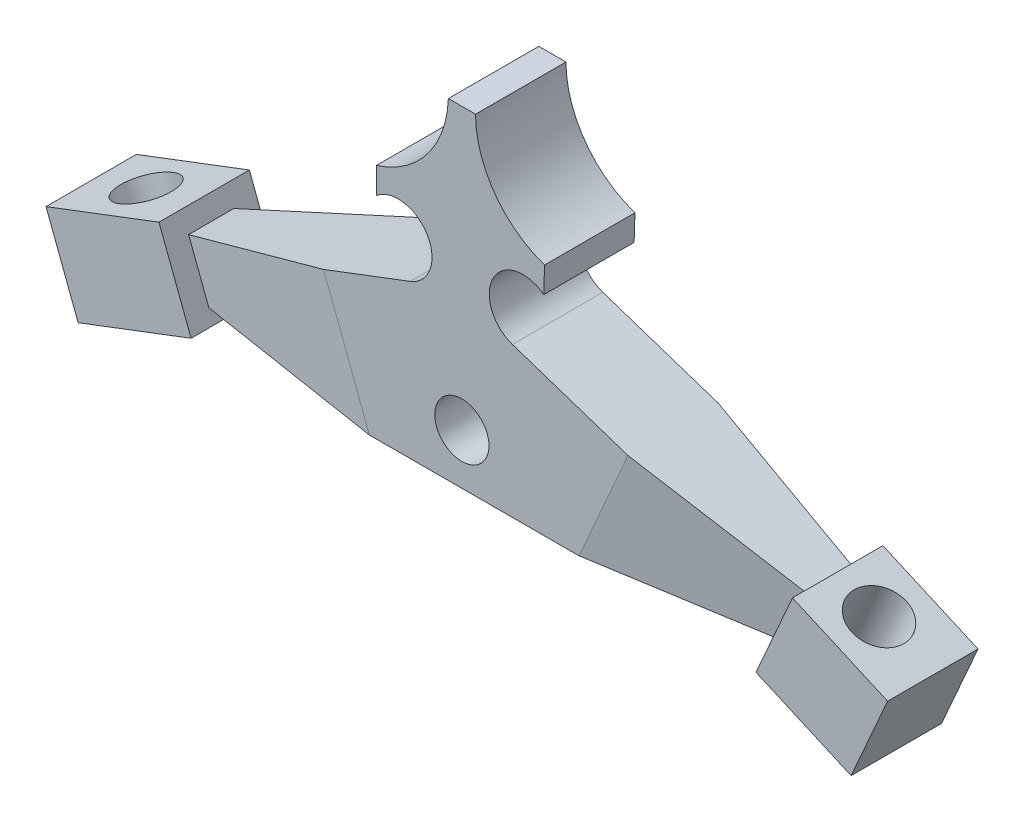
ISO-10303-21;
HEADER;
FILE_DESCRIPTION(('STEP AP214'),'2;1');
FILE_NAME('part.step','',(''),(''),'','','');
FILE_SCHEMA(('AUTOMOTIVE_DESIGN { 1 0 10303 214 1 1 1 1 }'));
ENDSEC;
DATA;
#1=APPLICATION_CONTEXT('core data for automotive mechanical design processes');
#2=APPLICATION_PROTOCOL_DEFINITION('international standard','automotive_design',2000,#1);
#3=PRODUCT_CONTEXT('',#1,'mechanical');
#4=PRODUCT('Part','Part','',(#3));
#5=PRODUCT_RELATED_PRODUCT_CATEGORY('part','',(#4));
#6=PRODUCT_DEFINITION_FORMATION('','',#4);
#7=PRODUCT_DEFINITION_CONTEXT('part definition',#1,'design');
#8=PRODUCT_DEFINITION('design','',#6,#7);
#9=PRODUCT_DEFINITION_SHAPE('','',#8);
#10=(LENGTH_UNIT() NAMED_UNIT(*) SI_UNIT(.MILLI.,.METRE.));
#11=(NAMED_UNIT(*) PLANE_ANGLE_UNIT() SI_UNIT($,.RADIAN.));
#12=(NAMED_UNIT(*) SI_UNIT($,.STERADIAN.) SOLID_ANGLE_UNIT());
#13=UNCERTAINTY_MEASURE_WITH_UNIT(LENGTH_MEASURE(1.E-05),#10,'distance_accuracy_value','');
#14=(GEOMETRIC_REPRESENTATION_CONTEXT(3) GLOBAL_UNCERTAINTY_ASSIGNED_CONTEXT((#13)) GLOBAL_UNIT_ASSIGNED_CONTEXT((#10,
#11,#12)) REPRESENTATION_CONTEXT('',''));
#15=CARTESIAN_POINT('',(0.,0.,0.));
#16=DIRECTION('',(0.,0.,1.));
#17=DIRECTION('',(1.,0.,0.));
#18=AXIS2_PLACEMENT_3D('',#15,#16,#17);
#19=CARTESIAN_POINT('',(0.,0.,0.));
#20=DIRECTION('',(0.,0.,1.));
#21=DIRECTION('',(1.,0.,0.));
#22=AXIS2_PLACEMENT_3D('',#19,#20,#21);
#23=PLANE('',#22);
#24=DIRECTION('',(-0.403545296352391,-0.914959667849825,0.));
#25=VECTOR('',#24,1.);
#26=CARTESIAN_POINT('',(36.5740452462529,2.21945965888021,0.));
#27=LINE('',#26,#25);
#28=CARTESIAN_POINT('',(36.5740452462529,2.21945965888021,0.));
#29=VERTEX_POINT('',#28);
#30=CARTESIAN_POINT('',(32.538592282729,-6.93013701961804,0.));
#31=VERTEX_POINT('',#30);
#32=EDGE_CURVE('E331',#29,#31,#27,.T.);
#33=ORIENTED_EDGE('',*,*,#32,.F.);
#34=DIRECTION('',(-0.914959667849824,0.403545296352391,0.));
#35=VECTOR('',#34,1.);
#36=CARTESIAN_POINT('',(36.5740452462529,2.21945965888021,0.));
#37=LINE('',#36,#35);
#38=CARTESIAN_POINT('',(47.0960814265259,-2.42131124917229,0.));
#39=VERTEX_POINT('',#38);
#40=EDGE_CURVE('E330',#39,#29,#37,.T.);
#41=ORIENTED_EDGE('',*,*,#40,.F.);
#42=DIRECTION('',(0.403545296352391,0.914959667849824,0.));
#43=VECTOR('',#42,1.);
#44=CARTESIAN_POINT('',(47.0960814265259,-2.42131124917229,0.));
#45=LINE('',#44,#43);
#46=CARTESIAN_POINT('',(43.060628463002,-11.5709079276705,0.));
#47=VERTEX_POINT('',#46);
#48=EDGE_CURVE('E348',#47,#39,#45,.T.);
#49=ORIENTED_EDGE('',*,*,#48,.F.);
#50=DIRECTION('',(0.914959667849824,-0.403545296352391,0.));
#51=VECTOR('',#50,1.);
#52=CARTESIAN_POINT('',(32.538592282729,-6.93013701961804,0.));
#53=LINE('',#52,#51);
#54=EDGE_CURVE('E346',#31,#47,#53,.T.);
#55=ORIENTED_EDGE('',*,*,#54,.F.);
#56=EDGE_LOOP('',(#33,#41,#49,#55));
#57=FACE_BOUND('',#56,.T.);
#58=ADVANCED_FACE('F33',(#57),#23,.F.);
#59=CARTESIAN_POINT('',(0.,0.,10.));
#60=DIRECTION('',(0.,0.,1.));
#61=DIRECTION('',(1.,0.,0.));
#62=AXIS2_PLACEMENT_3D('',#59,#60,#61);
#63=PLANE('',#62);
#64=DIRECTION('',(-0.999999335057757,-0.00115320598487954,0.));
#65=VECTOR('',#64,1.);
#66=CARTESIAN_POINT('',(-10.2343078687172,-5.58758670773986,10.));
#67=LINE('',#66,#65);
#68=CARTESIAN_POINT('',(12.949396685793,-5.56085110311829,10.));
#69=VERTEX_POINT('',#68);
#70=CARTESIAN_POINT('',(-10.2343078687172,-5.58758670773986,10.));
#71=VERTEX_POINT('',#70);
#72=EDGE_CURVE('E211',#69,#71,#67,.T.);
#73=ORIENTED_EDGE('',*,*,#72,.F.);
#74=DIRECTION('',(0.403545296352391,0.914959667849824,0.));
#75=VECTOR('',#74,1.);
#76=CARTESIAN_POINT('',(11.194897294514,-9.53883373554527,10.));
#77=LINE('',#76,#75);
#78=CARTESIAN_POINT('',(18.3801163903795,6.75223875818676,10.));
#79=VERTEX_POINT('',#78);
#80=EDGE_CURVE('E506',#69,#79,#77,.T.);
#81=ORIENTED_EDGE('',*,*,#80,.T.);
#82=DIRECTION('',(-0.948954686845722,0.315412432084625,0.));
#83=VECTOR('',#82,1.);
#84=CARTESIAN_POINT('',(18.3801163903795,6.75223875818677,10.));
#85=LINE('',#84,#83);
#86=CARTESIAN_POINT('',(5.59187159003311,11.0027803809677,10.));
#87=VERTEX_POINT('',#86);
#88=EDGE_CURVE('E264',#79,#87,#85,.T.);
#89=ORIENTED_EDGE('',*,*,#88,.T.);
#90=CARTESIAN_POINT('',(6.7714184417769,14.5515831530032,10.));
#91=DIRECTION('',(0.,0.,-1.));
#92=DIRECTION('',(-1.,0.,0.));
#93=AXIS2_PLACEMENT_3D('',#90,#91,#92);
#94=CIRCLE('',#93,3.73969676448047);
#95=CARTESIAN_POINT('',(9.0578474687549,17.5109030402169,10.));
#96=VERTEX_POINT('',#95);
#97=EDGE_CURVE('E265',#87,#96,#94,.T.);
#98=ORIENTED_EDGE('',*,*,#97,.T.);
#99=DIRECTION('',(0.0307893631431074,0.999525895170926,0.));
#100=VECTOR('',#99,1.);
#101=CARTESIAN_POINT('',(9.14667942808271,20.3946860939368,10.));
#102=LINE('',#101,#100);
#103=CARTESIAN_POINT('',(9.14667942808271,20.3946860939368,10.));
#104=VERTEX_POINT('',#103);
#105=EDGE_CURVE('E267',#96,#104,#102,.T.);
#106=ORIENTED_EDGE('',*,*,#105,.T.);
#107=CARTESIAN_POINT('',(12.7833787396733,31.065624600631,10.));
#108=DIRECTION('',(0.,0.,-1.));
#109=DIRECTION('',(1.,0.,0.));
#110=AXIS2_PLACEMENT_3D('',#107,#108,#109);
#111=CIRCLE('',#110,11.2736201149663);
#112=CARTESIAN_POINT('',(1.50985250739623,31.0196160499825,10.));
#113=VERTEX_POINT('',#112);
#114=EDGE_CURVE('E269',#104,#113,#111,.T.);
#115=ORIENTED_EDGE('',*,*,#114,.T.);
#116=DIRECTION('',(-1.,0.,0.));
#117=VECTOR('',#116,1.);
#118=CARTESIAN_POINT('',(1.50985250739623,31.0196160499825,10.));
#119=LINE('',#118,#117);
#120=CARTESIAN_POINT('',(-1.49014749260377,31.0196160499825,10.));
#121=VERTEX_POINT('',#120);
#122=EDGE_CURVE('E271',#113,#121,#119,.T.);
#123=ORIENTED_EDGE('',*,*,#122,.T.);
#124=CARTESIAN_POINT('',(-12.7569123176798,31.4127074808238,10.));
#125=DIRECTION('',(0.,0.,-1.));
#126=DIRECTION('',(-1.,0.,0.));
#127=AXIS2_PLACEMENT_3D('',#124,#125,#126);
#128=CIRCLE('',#127,11.2736201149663);
#129=CARTESIAN_POINT('',(-9.45048858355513,20.6348564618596,10.));
#130=VERTEX_POINT('',#129);
#131=EDGE_CURVE('E255',#121,#130,#128,.T.);
#132=ORIENTED_EDGE('',*,*,#131,.T.);
#133=DIRECTION('',(0.,-1.,0.));
#134=VECTOR('',#133,1.);
#135=CARTESIAN_POINT('',(-9.45048858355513,20.6348564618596,10.));
#136=LINE('',#135,#134);
#137=CARTESIAN_POINT('',(-9.45048858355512,17.749705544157,10.));
#138=VERTEX_POINT('',#137);
#139=EDGE_CURVE('E258',#130,#138,#136,.T.);
#140=ORIENTED_EDGE('',*,*,#139,.T.);
#141=CARTESIAN_POINT('',(-7.03993104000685,14.890589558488,10.));
#142=DIRECTION('',(0.,0.,-1.));
#143=DIRECTION('',(1.,0.,0.));
#144=AXIS2_PLACEMENT_3D('',#141,#142,#143);
#145=CIRCLE('',#144,3.73969676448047);
#146=CARTESIAN_POINT('',(-5.71010838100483,11.3953208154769,10.));
#147=VERTEX_POINT('',#146);
#148=EDGE_CURVE('E261',#138,#147,#145,.T.);
#149=ORIENTED_EDGE('',*,*,#148,.T.);
#150=DIRECTION('',(-0.934639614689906,-0.355596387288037,0.));
#151=VECTOR('',#150,1.);
#152=CARTESIAN_POINT('',(-15.3065735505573,7.74421477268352,10.));
#153=LINE('',#152,#151);
#154=CARTESIAN_POINT('',(-15.3065735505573,7.74421477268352,10.));
#155=VERTEX_POINT('',#154);
#156=EDGE_CURVE('E588',#147,#155,#153,.T.);
#157=ORIENTED_EDGE('',*,*,#156,.T.);
#158=DIRECTION('',(-0.355596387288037,0.934639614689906,0.));
#159=VECTOR('',#158,1.);
#160=CARTESIAN_POINT('',(-9.97262774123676,-6.27537944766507,10.));
#161=LINE('',#160,#159);
#162=EDGE_CURVE('E494',#71,#155,#161,.T.);
#163=ORIENTED_EDGE('',*,*,#162,.F.);
#164=EDGE_LOOP('',(#73,#81,#89,#98,#106,#115,#123,#132,#140,#149,#157,#163));
#165=FACE_BOUND('',#164,.T.);
#166=CARTESIAN_POINT('',(0.,0.,10.));
#167=DIRECTION('',(0.,0.,1.));
#168=DIRECTION('',(1.,0.,0.));
#169=AXIS2_PLACEMENT_3D('',#166,#167,#168);
#170=CIRCLE('',#169,3.);
#171=CARTESIAN_POINT('',(3.,0.,10.));
#172=VERTEX_POINT('',#171);
#173=EDGE_CURVE('E236',#172,#172,#170,.T.);
#174=ORIENTED_EDGE('',*,*,#173,.F.);
#175=EDGE_LOOP('',(#174));
#176=FACE_BOUND('',#175,.T.);
#177=ADVANCED_FACE('F385',(#165,#176),#63,.T.);
#178=DIRECTION('',(-0.403545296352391,-0.914959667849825,0.));
#179=VECTOR('',#178,1.);
#180=CARTESIAN_POINT('',(36.5740452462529,2.21945965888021,10.));
#181=LINE('',#180,#179);
#182=CARTESIAN_POINT('',(36.5740452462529,2.21945965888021,10.));
#183=VERTEX_POINT('',#182);
#184=CARTESIAN_POINT('',(32.538592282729,-6.93013701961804,10.));
#185=VERTEX_POINT('',#184);
#186=EDGE_CURVE('E326',#183,#185,#181,.T.);
#187=ORIENTED_EDGE('',*,*,#186,.T.);
#188=DIRECTION('',(0.914959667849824,-0.403545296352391,0.));
#189=VECTOR('',#188,1.);
#190=CARTESIAN_POINT('',(32.538592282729,-6.93013701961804,10.));
#191=LINE('',#190,#189);
#192=CARTESIAN_POINT('',(43.060628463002,-11.5709079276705,10.));
#193=VERTEX_POINT('',#192);
#194=EDGE_CURVE('E329',#185,#193,#191,.T.);
#195=ORIENTED_EDGE('',*,*,#194,.T.);
#196=DIRECTION('',(0.403545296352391,0.914959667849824,0.));
#197=VECTOR('',#196,1.);
#198=CARTESIAN_POINT('',(47.0960814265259,-2.42131124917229,10.));
#199=LINE('',#198,#197);
#200=CARTESIAN_POINT('',(47.0960814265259,-2.42131124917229,10.));
#201=VERTEX_POINT('',#200);
#202=EDGE_CURVE('E340',#193,#201,#199,.T.);
#203=ORIENTED_EDGE('',*,*,#202,.T.);
#204=DIRECTION('',(-0.914959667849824,0.403545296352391,0.));
#205=VECTOR('',#204,1.);
#206=CARTESIAN_POINT('',(36.5740452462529,2.21945965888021,10.));
#207=LINE('',#206,#205);
#208=EDGE_CURVE('E342',#201,#183,#207,.T.);
#209=ORIENTED_EDGE('',*,*,#208,.T.);
#210=EDGE_LOOP('',(#187,#195,#203,#209));
#211=FACE_BOUND('',#210,.T.);
#212=ADVANCED_FACE('F382',(#211),#63,.T.);
#213=CARTESIAN_POINT('',(18.3801163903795,6.75223875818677,10.));
#214=DIRECTION('',(-0.315412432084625,-0.948954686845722,0.));
#215=DIRECTION('',(0.948954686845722,-0.315412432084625,0.));
#216=AXIS2_PLACEMENT_3D('',#213,#214,#215);
#217=PLANE('',#216);
#218=DIRECTION('',(0.,0.,-1.));
#219=VECTOR('',#218,1.);
#220=CARTESIAN_POINT('',(35.9914750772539,0.898596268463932,10.));
#221=LINE('',#220,#219);
#222=CARTESIAN_POINT('',(35.9914750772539,0.89859626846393,7.5));
#223=VERTEX_POINT('',#222);
#224=CARTESIAN_POINT('',(35.9914750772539,0.898596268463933,2.5));
#225=VERTEX_POINT('',#224);
#226=EDGE_CURVE('E238',#223,#225,#221,.T.);
#227=ORIENTED_EDGE('',*,*,#226,.T.);
#228=DIRECTION('',(-0.940460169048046,0.31258903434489,-0.13350193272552));
#229=VECTOR('',#228,1.);
#230=CARTESIAN_POINT('',(19.6356488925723,6.3349263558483,0.178227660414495));
#231=LINE('',#230,#229);
#232=CARTESIAN_POINT('',(18.3801163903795,6.75223875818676,0.));
#233=VERTEX_POINT('',#232);
#234=EDGE_CURVE('E222',#225,#233,#231,.T.);
#235=ORIENTED_EDGE('',*,*,#234,.T.);
#236=DIRECTION('',(-0.948954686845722,0.315412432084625,0.));
#237=VECTOR('',#236,1.);
#238=CARTESIAN_POINT('',(18.3801163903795,6.75223875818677,0.));
#239=LINE('',#238,#237);
#240=CARTESIAN_POINT('',(5.59187159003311,11.0027803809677,0.));
#241=VERTEX_POINT('',#240);
#242=EDGE_CURVE('E227',#233,#241,#239,.T.);
#243=ORIENTED_EDGE('',*,*,#242,.T.);
#244=DIRECTION('',(0.,0.,-1.));
#245=VECTOR('',#244,1.);
#246=CARTESIAN_POINT('',(5.59187159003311,11.0027803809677,10.));
#247=LINE('',#246,#245);
#248=EDGE_CURVE('E299',#87,#241,#247,.T.);
#249=ORIENTED_EDGE('',*,*,#248,.F.);
#250=ORIENTED_EDGE('',*,*,#88,.F.);
#251=DIRECTION('',(-0.940460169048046,0.31258903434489,0.13350193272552));
#252=VECTOR('',#251,1.);
#253=CARTESIAN_POINT('',(18.3801163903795,6.75223875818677,10.));
#254=LINE('',#253,#252);
#255=EDGE_CURVE('E501',#223,#79,#254,.T.);
#256=ORIENTED_EDGE('',*,*,#255,.F.);
#257=EDGE_LOOP('',(#227,#235,#243,#249,#250,#256));
#258=FACE_BOUND('',#257,.T.);
#259=ADVANCED_FACE('F384',(#258),#217,.F.);
#260=CARTESIAN_POINT('',(12.949396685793,-5.56085110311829,10.));
#261=DIRECTION('',(-0.0338932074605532,0.999425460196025,0.));
#262=DIRECTION('',(-0.999425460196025,-0.0338932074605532,0.));
#263=AXIS2_PLACEMENT_3D('',#260,#261,#262);
#264=PLANE('',#263);
#265=DIRECTION('',(0.,0.,-1.));
#266=VECTOR('',#265,1.);
#267=CARTESIAN_POINT('',(12.949396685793,-5.56085110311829,10.));
#268=LINE('',#267,#266);
#269=CARTESIAN_POINT('',(12.949396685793,-5.56085110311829,0.));
#270=VERTEX_POINT('',#269);
#271=EDGE_CURVE('E202',#69,#270,#268,.T.);
#272=ORIENTED_EDGE('',*,*,#271,.T.);
#273=DIRECTION('',(0.992083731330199,0.0336442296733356,0.120987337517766));
#274=VECTOR('',#273,1.);
#275=CARTESIAN_POINT('',(14.1496923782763,-5.52014584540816,0.146379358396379));
#276=LINE('',#275,#274);
#277=CARTESIAN_POINT('',(33.4491397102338,-4.86564963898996,2.5));
#278=VERTEX_POINT('',#277);
#279=EDGE_CURVE('E214',#270,#278,#276,.T.);
#280=ORIENTED_EDGE('',*,*,#279,.T.);
#281=DIRECTION('',(0.,0.,-1.));
#282=VECTOR('',#281,1.);
#283=CARTESIAN_POINT('',(33.4491397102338,-4.86564963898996,10.));
#284=LINE('',#283,#282);
#285=CARTESIAN_POINT('',(33.4491397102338,-4.86564963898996,7.5));
#286=VERTEX_POINT('',#285);
#287=EDGE_CURVE('E233',#286,#278,#284,.T.);
#288=ORIENTED_EDGE('',*,*,#287,.F.);
#289=DIRECTION('',(0.992083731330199,0.0336442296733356,-0.120987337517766));
#290=VECTOR('',#289,1.);
#291=CARTESIAN_POINT('',(12.949396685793,-5.56085110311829,10.));
#292=LINE('',#291,#290);
#293=EDGE_CURVE('E231',#69,#286,#292,.T.);
#294=ORIENTED_EDGE('',*,*,#293,.F.);
#295=EDGE_LOOP('',(#272,#280,#288,#294));
#296=FACE_BOUND('',#295,.T.);
#297=ADVANCED_FACE('F230',(#296),#264,.F.);
#298=DIRECTION('',(-0.355596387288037,0.934639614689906,0.));
#299=VECTOR('',#298,1.);
#300=CARTESIAN_POINT('',(-33.5066506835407,3.16831982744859,10.));
#301=LINE('',#300,#299);
#302=CARTESIAN_POINT('',(-29.9506868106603,-6.17807631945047,10.));
#303=VERTEX_POINT('',#302);
#304=CARTESIAN_POINT('',(-33.5066506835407,3.16831982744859,10.));
#305=VERTEX_POINT('',#304);
#306=EDGE_CURVE('E447',#303,#305,#301,.T.);
#307=ORIENTED_EDGE('',*,*,#306,.T.);
#308=DIRECTION('',(-0.934639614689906,-0.355596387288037,0.));
#309=VECTOR('',#308,1.);
#310=CARTESIAN_POINT('',(-46.0027823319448,-1.58600387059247,10.));
#311=LINE('',#310,#309);
#312=CARTESIAN_POINT('',(-46.0027823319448,-1.58600387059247,10.));
#313=VERTEX_POINT('',#312);
#314=EDGE_CURVE('E444',#305,#313,#311,.T.);
#315=ORIENTED_EDGE('',*,*,#314,.T.);
#316=DIRECTION('',(0.355596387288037,-0.934639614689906,0.));
#317=VECTOR('',#316,1.);
#318=CARTESIAN_POINT('',(-46.0027823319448,-1.58600387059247,10.));
#319=LINE('',#318,#317);
#320=CARTESIAN_POINT('',(-42.4468184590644,-10.9324000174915,10.));
#321=VERTEX_POINT('',#320);
#322=EDGE_CURVE('E431',#313,#321,#319,.T.);
#323=ORIENTED_EDGE('',*,*,#322,.T.);
#324=DIRECTION('',(0.934639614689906,0.355596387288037,0.));
#325=VECTOR('',#324,1.);
#326=CARTESIAN_POINT('',(-42.4468184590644,-10.9324000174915,10.));
#327=LINE('',#326,#325);
#328=EDGE_CURVE('E434',#321,#303,#327,.T.);
#329=ORIENTED_EDGE('',*,*,#328,.T.);
#330=EDGE_LOOP('',(#307,#315,#323,#329));
#331=FACE_BOUND('',#330,.T.);
#332=ADVANCED_FACE('F387',(#331),#63,.T.);
#333=CARTESIAN_POINT('',(0.,0.,0.));
#334=DIRECTION('',(0.,0.,1.));
#335=DIRECTION('',(1.,0.,0.));
#336=AXIS2_PLACEMENT_3D('',#333,#334,#335);
#337=CIRCLE('',#336,3.);
#338=CARTESIAN_POINT('',(3.,0.,0.));
#339=VERTEX_POINT('',#338);
#340=EDGE_CURVE('E232',#339,#339,#337,.T.);
#341=ORIENTED_EDGE('',*,*,#340,.T.);
#342=EDGE_LOOP('',(#341));
#343=FACE_BOUND('',#342,.T.);
#344=DIRECTION('',(0.403545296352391,0.914959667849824,0.));
#345=VECTOR('',#344,1.);
#346=CARTESIAN_POINT('',(11.1948972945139,-9.53883373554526,0.));
#347=LINE('',#346,#345);
#348=EDGE_CURVE('E216',#270,#233,#347,.T.);
#349=ORIENTED_EDGE('',*,*,#348,.F.);
#350=DIRECTION('',(-0.999999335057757,-0.00115320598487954,0.));
#351=VECTOR('',#350,1.);
#352=CARTESIAN_POINT('',(-10.2343078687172,-5.58758670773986,0.));
#353=LINE('',#352,#351);
#354=CARTESIAN_POINT('',(-10.2343078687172,-5.58758670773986,0.));
#355=VERTEX_POINT('',#354);
#356=EDGE_CURVE('E198',#270,#355,#353,.T.);
#357=ORIENTED_EDGE('',*,*,#356,.T.);
#358=DIRECTION('',(-0.355596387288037,0.934639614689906,0.));
#359=VECTOR('',#358,1.);
#360=CARTESIAN_POINT('',(-9.97262774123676,-6.27537944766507,0.));
#361=LINE('',#360,#359);
#362=CARTESIAN_POINT('',(-15.3065735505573,7.74421477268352,0.));
#363=VERTEX_POINT('',#362);
#364=EDGE_CURVE('E481',#355,#363,#361,.T.);
#365=ORIENTED_EDGE('',*,*,#364,.T.);
#366=DIRECTION('',(-0.934639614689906,-0.355596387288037,0.));
#367=VECTOR('',#366,1.);
#368=CARTESIAN_POINT('',(-15.3065735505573,7.74421477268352,0.));
#369=LINE('',#368,#367);
#370=CARTESIAN_POINT('',(-5.71010838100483,11.3953208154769,0.));
#371=VERTEX_POINT('',#370);
#372=EDGE_CURVE('E310',#371,#363,#369,.T.);
#373=ORIENTED_EDGE('',*,*,#372,.F.);
#374=CARTESIAN_POINT('',(-7.03993104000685,14.890589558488,0.));
#375=DIRECTION('',(0.,0.,-1.));
#376=DIRECTION('',(1.,0.,0.));
#377=AXIS2_PLACEMENT_3D('',#374,#375,#376);
#378=CIRCLE('',#377,3.73969676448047);
#379=CARTESIAN_POINT('',(-9.45048858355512,17.749705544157,0.));
#380=VERTEX_POINT('',#379);
#381=EDGE_CURVE('E278',#380,#371,#378,.T.);
#382=ORIENTED_EDGE('',*,*,#381,.F.);
#383=DIRECTION('',(0.,-1.,0.));
#384=VECTOR('',#383,1.);
#385=CARTESIAN_POINT('',(-9.45048858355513,20.6348564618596,0.));
#386=LINE('',#385,#384);
#387=CARTESIAN_POINT('',(-9.45048858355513,20.6348564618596,0.));
#388=VERTEX_POINT('',#387);
#389=EDGE_CURVE('E276',#388,#380,#386,.T.);
#390=ORIENTED_EDGE('',*,*,#389,.F.);
#391=CARTESIAN_POINT('',(-12.7569123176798,31.4127074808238,0.));
#392=DIRECTION('',(0.,0.,-1.));
#393=DIRECTION('',(-1.,0.,0.));
#394=AXIS2_PLACEMENT_3D('',#391,#392,#393);
#395=CIRCLE('',#394,11.2736201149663);
#396=CARTESIAN_POINT('',(-1.49014749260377,31.0196160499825,0.));
#397=VERTEX_POINT('',#396);
#398=EDGE_CURVE('E253',#397,#388,#395,.T.);
#399=ORIENTED_EDGE('',*,*,#398,.F.);
#400=DIRECTION('',(-1.,0.,0.));
#401=VECTOR('',#400,1.);
#402=CARTESIAN_POINT('',(1.50985250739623,31.0196160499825,0.));
#403=LINE('',#402,#401);
#404=CARTESIAN_POINT('',(1.50985250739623,31.0196160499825,0.));
#405=VERTEX_POINT('',#404);
#406=EDGE_CURVE('E259',#405,#397,#403,.T.);
#407=ORIENTED_EDGE('',*,*,#406,.F.);
#408=CARTESIAN_POINT('',(12.7833787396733,31.065624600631,0.));
#409=DIRECTION('',(0.,0.,-1.));
#410=DIRECTION('',(1.,0.,0.));
#411=AXIS2_PLACEMENT_3D('',#408,#409,#410);
#412=CIRCLE('',#411,11.2736201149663);
#413=CARTESIAN_POINT('',(9.14667942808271,20.3946860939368,0.));
#414=VERTEX_POINT('',#413);
#415=EDGE_CURVE('E285',#414,#405,#412,.T.);
#416=ORIENTED_EDGE('',*,*,#415,.F.);
#417=DIRECTION('',(0.0307893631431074,0.999525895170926,0.));
#418=VECTOR('',#417,1.);
#419=CARTESIAN_POINT('',(9.14667942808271,20.3946860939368,0.));
#420=LINE('',#419,#418);
#421=CARTESIAN_POINT('',(9.0578474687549,17.5109030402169,0.));
#422=VERTEX_POINT('',#421);
#423=EDGE_CURVE('E283',#422,#414,#420,.T.);
#424=ORIENTED_EDGE('',*,*,#423,.F.);
#425=CARTESIAN_POINT('',(6.7714184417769,14.5515831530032,0.));
#426=DIRECTION('',(0.,0.,-1.));
#427=DIRECTION('',(-1.,0.,0.));
#428=AXIS2_PLACEMENT_3D('',#425,#426,#427);
#429=CIRCLE('',#428,3.73969676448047);
#430=EDGE_CURVE('E281',#241,#422,#429,.T.);
#431=ORIENTED_EDGE('',*,*,#430,.F.);
#432=ORIENTED_EDGE('',*,*,#242,.F.);
#433=EDGE_LOOP('',(#349,#357,#365,#373,#382,#390,#399,#407,#416,#424,#431,#432));
#434=FACE_BOUND('',#433,.T.);
#435=ADVANCED_FACE('F225',(#343,#434),#23,.F.);
#436=CARTESIAN_POINT('',(-15.3065735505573,7.74421477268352,10.));
#437=DIRECTION('',(0.355596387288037,-0.934639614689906,0.));
#438=DIRECTION('',(0.934639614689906,0.355596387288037,0.));
#439=AXIS2_PLACEMENT_3D('',#436,#437,#438);
#440=PLANE('',#439);
#441=DIRECTION('',(0.,0.,-1.));
#442=VECTOR('',#441,1.);
#443=CARTESIAN_POINT('',(-32.726092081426,1.11672139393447,10.));
#444=LINE('',#443,#442);
#445=CARTESIAN_POINT('',(-32.726092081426,1.11672139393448,7.5));
#446=VERTEX_POINT('',#445);
#447=CARTESIAN_POINT('',(-32.726092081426,1.11672139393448,2.5));
#448=VERTEX_POINT('',#447);
#449=EDGE_CURVE('E320',#446,#448,#444,.T.);
#450=ORIENTED_EDGE('',*,*,#449,.F.);
#451=DIRECTION('',(-0.926343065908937,-0.352439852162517,-0.132946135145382));
#452=VECTOR('',#451,1.);
#453=CARTESIAN_POINT('',(-5.93169732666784,11.3110142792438,11.3454557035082));
#454=LINE('',#453,#452);
#455=EDGE_CURVE('E496',#155,#446,#454,.T.);
#456=ORIENTED_EDGE('',*,*,#455,.F.);
#457=ORIENTED_EDGE('',*,*,#156,.F.);
#458=DIRECTION('',(0.,0.,-1.));
#459=VECTOR('',#458,1.);
#460=CARTESIAN_POINT('',(-5.71010838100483,11.3953208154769,10.));
#461=LINE('',#460,#459);
#462=EDGE_CURVE('E302',#147,#371,#461,.T.);
#463=ORIENTED_EDGE('',*,*,#462,.T.);
#464=ORIENTED_EDGE('',*,*,#372,.T.);
#465=DIRECTION('',(-0.926343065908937,-0.352439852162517,0.132946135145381));
#466=VECTOR('',#465,1.);
#467=CARTESIAN_POINT('',(-4.70016002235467,11.7795694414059,-1.52220245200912));
#468=LINE('',#467,#466);
#469=EDGE_CURVE('E486',#363,#448,#468,.T.);
#470=ORIENTED_EDGE('',*,*,#469,.T.);
#471=EDGE_LOOP('',(#450,#456,#457,#463,#464,#470));
#472=FACE_BOUND('',#471,.T.);
#473=ADVANCED_FACE('F405',(#472),#440,.F.);
#474=CARTESIAN_POINT('',(-30.4858348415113,-4.77150817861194,10.));
#475=DIRECTION('',(0.0402644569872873,0.999189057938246,0.));
#476=DIRECTION('',(-0.999189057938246,0.0402644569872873,0.));
#477=AXIS2_PLACEMENT_3D('',#474,#475,#476);
#478=PLANE('',#477);
#479=DIRECTION('',(0.,0.,-1.));
#480=VECTOR('',#479,1.);
#481=CARTESIAN_POINT('',(-10.2343078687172,-5.58758670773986,10.));
#482=LINE('',#481,#480);
#483=EDGE_CURVE('E205',#71,#355,#482,.T.);
#484=ORIENTED_EDGE('',*,*,#483,.F.);
#485=DIRECTION('',(-0.991673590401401,0.0399616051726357,-0.122419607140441));
#486=VECTOR('',#485,1.);
#487=CARTESIAN_POINT('',(-30.1823341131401,-4.78373838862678,7.53746640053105));
#488=LINE('',#487,#486);
#489=CARTESIAN_POINT('',(-30.4858348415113,-4.77150817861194,7.5));
#490=VERTEX_POINT('',#489);
#491=EDGE_CURVE('E490',#71,#490,#488,.T.);
#492=ORIENTED_EDGE('',*,*,#491,.T.);
#493=DIRECTION('',(0.,0.,-1.));
#494=VECTOR('',#493,1.);
#495=CARTESIAN_POINT('',(-30.4858348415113,-4.77150817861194,10.));
#496=LINE('',#495,#494);
#497=CARTESIAN_POINT('',(-30.4858348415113,-4.77150817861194,2.5));
#498=VERTEX_POINT('',#497);
#499=EDGE_CURVE('E58',#490,#498,#496,.T.);
#500=ORIENTED_EDGE('',*,*,#499,.T.);
#501=DIRECTION('',(-0.991673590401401,0.0399616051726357,0.122419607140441));
#502=VECTOR('',#501,1.);
#503=CARTESIAN_POINT('',(-31.396337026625,-4.73481754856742,2.61239920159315));
#504=LINE('',#503,#502);
#505=EDGE_CURVE('E372',#355,#498,#504,.T.);
#506=ORIENTED_EDGE('',*,*,#505,.F.);
#507=EDGE_LOOP('',(#484,#492,#500,#506));
#508=FACE_BOUND('',#507,.T.);
#509=ADVANCED_FACE('F578',(#508),#478,.F.);
#510=CARTESIAN_POINT('',(-46.0027823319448,-1.58600387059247,10.));
#511=DIRECTION('',(0.934639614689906,0.355596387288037,0.));
#512=DIRECTION('',(-0.355596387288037,0.934639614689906,0.));
#513=AXIS2_PLACEMENT_3D('',#510,#511,#512);
#514=PLANE('',#513);
#515=DIRECTION('',(0.355596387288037,-0.934639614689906,0.));
#516=VECTOR('',#515,1.);
#517=CARTESIAN_POINT('',(-46.0027823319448,-1.58600387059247,0.));
#518=LINE('',#517,#516);
#519=CARTESIAN_POINT('',(-46.0027823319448,-1.58600387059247,0.));
#520=VERTEX_POINT('',#519);
#521=CARTESIAN_POINT('',(-42.4468184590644,-10.9324000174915,0.));
#522=VERTEX_POINT('',#521);
#523=EDGE_CURVE('E426',#520,#522,#518,.T.);
#524=ORIENTED_EDGE('',*,*,#523,.T.);
#525=DIRECTION('',(0.,0.,-1.));
#526=VECTOR('',#525,1.);
#527=CARTESIAN_POINT('',(-42.4468184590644,-10.9324000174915,10.));
#528=LINE('',#527,#526);
#529=EDGE_CURVE('E11',#321,#522,#528,.T.);
#530=ORIENTED_EDGE('',*,*,#529,.F.);
#531=ORIENTED_EDGE('',*,*,#322,.F.);
#532=DIRECTION('',(0.,0.,-1.));
#533=VECTOR('',#532,1.);
#534=CARTESIAN_POINT('',(-46.0027823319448,-1.58600387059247,10.));
#535=LINE('',#534,#533);
#536=EDGE_CURVE('E441',#313,#520,#535,.T.);
#537=ORIENTED_EDGE('',*,*,#536,.T.);
#538=EDGE_LOOP('',(#524,#530,#531,#537));
#539=FACE_BOUND('',#538,.T.);
#540=ADVANCED_FACE('F35',(#539),#514,.F.);
#541=CARTESIAN_POINT('',(-42.4468184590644,-10.9324000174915,10.));
#542=DIRECTION('',(-0.355596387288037,0.934639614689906,0.));
#543=DIRECTION('',(-0.934639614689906,-0.355596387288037,0.));
#544=AXIS2_PLACEMENT_3D('',#541,#542,#543);
#545=PLANE('',#544);
#546=CARTESIAN_POINT('',(-36.37166096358,-8.62102350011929,5.));
#547=DIRECTION('',(-0.355596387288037,0.934639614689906,0.));
#548=DIRECTION('',(-0.934639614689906,-0.355596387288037,0.));
#549=AXIS2_PLACEMENT_3D('',#546,#547,#548);
#550=CIRCLE('',#549,3.);
#551=CARTESIAN_POINT('',(-39.1755798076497,-9.6878126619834,5.));
#552=VERTEX_POINT('',#551);
#553=EDGE_CURVE('E518',#552,#552,#550,.T.);
#554=ORIENTED_EDGE('',*,*,#553,.T.);
#555=EDGE_LOOP('',(#554));
#556=FACE_BOUND('',#555,.T.);
#557=DIRECTION('',(0.934639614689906,0.355596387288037,0.));
#558=VECTOR('',#557,1.);
#559=CARTESIAN_POINT('',(-42.4468184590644,-10.9324000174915,0.));
#560=LINE('',#559,#558);
#561=CARTESIAN_POINT('',(-29.9506868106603,-6.17807631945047,0.));
#562=VERTEX_POINT('',#561);
#563=EDGE_CURVE('E435',#522,#562,#560,.T.);
#564=ORIENTED_EDGE('',*,*,#563,.T.);
#565=DIRECTION('',(0.,0.,-1.));
#566=VECTOR('',#565,1.);
#567=CARTESIAN_POINT('',(-29.9506868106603,-6.17807631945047,10.));
#568=LINE('',#567,#566);
#569=EDGE_CURVE('E42',#303,#562,#568,.T.);
#570=ORIENTED_EDGE('',*,*,#569,.F.);
#571=ORIENTED_EDGE('',*,*,#328,.F.);
#572=ORIENTED_EDGE('',*,*,#529,.T.);
#573=EDGE_LOOP('',(#564,#570,#571,#572));
#574=FACE_BOUND('',#573,.T.);
#575=ADVANCED_FACE('F458',(#556,#574),#545,.F.);
#576=CARTESIAN_POINT('',(-33.5066506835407,3.16831982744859,10.));
#577=DIRECTION('',(-0.934639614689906,-0.355596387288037,0.));
#578=DIRECTION('',(0.355596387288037,-0.934639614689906,0.));
#579=AXIS2_PLACEMENT_3D('',#576,#577,#578);
#580=PLANE('',#579);
#581=ORIENTED_EDGE('',*,*,#499,.F.);
#582=DIRECTION('',(-0.355596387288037,0.934639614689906,0.));
#583=VECTOR('',#582,1.);
#584=CARTESIAN_POINT('',(-27.3921462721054,-12.9028728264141,7.5));
#585=LINE('',#584,#583);
#586=EDGE_CURVE('E473',#490,#446,#585,.T.);
#587=ORIENTED_EDGE('',*,*,#586,.T.);
#588=ORIENTED_EDGE('',*,*,#449,.T.);
#589=DIRECTION('',(-0.355596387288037,0.934639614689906,0.));
#590=VECTOR('',#589,1.);
#591=CARTESIAN_POINT('',(-27.3921462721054,-12.9028728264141,2.5));
#592=LINE('',#591,#590);
#593=EDGE_CURVE('E476',#498,#448,#592,.T.);
#594=ORIENTED_EDGE('',*,*,#593,.F.);
#595=EDGE_LOOP('',(#581,#587,#588,#594));
#596=FACE_BOUND('',#595,.T.);
#597=DIRECTION('',(0.,0.,-1.));
#598=VECTOR('',#597,1.);
#599=CARTESIAN_POINT('',(-33.5066506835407,3.16831982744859,10.));
#600=LINE('',#599,#598);
#601=CARTESIAN_POINT('',(-33.5066506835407,3.16831982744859,0.));
#602=VERTEX_POINT('',#601);
#603=EDGE_CURVE('E443',#305,#602,#600,.T.);
#604=ORIENTED_EDGE('',*,*,#603,.F.);
#605=ORIENTED_EDGE('',*,*,#306,.F.);
#606=ORIENTED_EDGE('',*,*,#569,.T.);
#607=DIRECTION('',(-0.355596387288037,0.934639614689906,0.));
#608=VECTOR('',#607,1.);
#609=CARTESIAN_POINT('',(-33.5066506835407,3.16831982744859,0.));
#610=LINE('',#609,#608);
#611=EDGE_CURVE('E424',#562,#602,#610,.T.);
#612=ORIENTED_EDGE('',*,*,#611,.T.);
#613=EDGE_LOOP('',(#604,#605,#606,#612));
#614=FACE_BOUND('',#613,.T.);
#615=ADVANCED_FACE('F418',(#596,#614),#580,.F.);
#616=CARTESIAN_POINT('',(-46.0027823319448,-1.58600387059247,10.));
#617=DIRECTION('',(0.355596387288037,-0.934639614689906,0.));
#618=DIRECTION('',(0.934639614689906,0.355596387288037,0.));
#619=AXIS2_PLACEMENT_3D('',#616,#617,#618);
#620=PLANE('',#619);
#621=CARTESIAN_POINT('',(-39.9276248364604,0.725372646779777,5.));
#622=DIRECTION('',(-0.355596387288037,0.934639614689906,0.));
#623=DIRECTION('',(-0.934639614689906,-0.355596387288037,0.));
#624=AXIS2_PLACEMENT_3D('',#621,#622,#623);
#625=CIRCLE('',#624,3.);
#626=CARTESIAN_POINT('',(-42.7315436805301,-0.341416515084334,5.));
#627=VERTEX_POINT('',#626);
#628=EDGE_CURVE('E521',#627,#627,#625,.T.);
#629=ORIENTED_EDGE('',*,*,#628,.F.);
#630=EDGE_LOOP('',(#629));
#631=FACE_BOUND('',#630,.T.);
#632=DIRECTION('',(-0.934639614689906,-0.355596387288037,0.));
#633=VECTOR('',#632,1.);
#634=CARTESIAN_POINT('',(-46.0027823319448,-1.58600387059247,0.));
#635=LINE('',#634,#633);
#636=EDGE_CURVE('E423',#602,#520,#635,.T.);
#637=ORIENTED_EDGE('',*,*,#636,.T.);
#638=ORIENTED_EDGE('',*,*,#536,.F.);
#639=ORIENTED_EDGE('',*,*,#314,.F.);
#640=ORIENTED_EDGE('',*,*,#603,.T.);
#641=EDGE_LOOP('',(#637,#638,#639,#640));
#642=FACE_BOUND('',#641,.T.);
#643=ADVANCED_FACE('F409',(#631,#642),#620,.F.);
#644=ORIENTED_EDGE('',*,*,#636,.F.);
#645=ORIENTED_EDGE('',*,*,#611,.F.);
#646=ORIENTED_EDGE('',*,*,#563,.F.);
#647=ORIENTED_EDGE('',*,*,#523,.F.);
#648=EDGE_LOOP('',(#644,#645,#646,#647));
#649=FACE_BOUND('',#648,.T.);
#650=ADVANCED_FACE('F400',(#649),#23,.F.);
#651=CARTESIAN_POINT('',(-12.7569123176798,31.4127074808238,10.));
#652=DIRECTION('',(0.,0.,-1.));
#653=DIRECTION('',(-1.,0.,0.));
#654=AXIS2_PLACEMENT_3D('',#651,#652,#653);
#655=CYLINDRICAL_SURFACE('',#654,11.2736201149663);
#656=ORIENTED_EDGE('',*,*,#398,.T.);
#657=DIRECTION('',(0.,0.,-1.));
#658=VECTOR('',#657,1.);
#659=CARTESIAN_POINT('',(-9.45048858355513,20.6348564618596,10.));
#660=LINE('',#659,#658);
#661=EDGE_CURVE('E308',#130,#388,#660,.T.);
#662=ORIENTED_EDGE('',*,*,#661,.F.);
#663=ORIENTED_EDGE('',*,*,#131,.F.);
#664=DIRECTION('',(0.,0.,-1.));
#665=VECTOR('',#664,1.);
#666=CARTESIAN_POINT('',(-1.49014749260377,31.0196160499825,10.));
#667=LINE('',#666,#665);
#668=EDGE_CURVE('E273',#121,#397,#667,.T.);
#669=ORIENTED_EDGE('',*,*,#668,.T.);
#670=EDGE_LOOP('',(#656,#662,#663,#669));
#671=FACE_BOUND('',#670,.T.);
#672=ADVANCED_FACE('F408',(#671),#655,.F.);
#673=CARTESIAN_POINT('',(-9.45048858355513,20.6348564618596,10.));
#674=DIRECTION('',(1.,0.,0.));
#675=DIRECTION('',(0.,1.,0.));
#676=AXIS2_PLACEMENT_3D('',#673,#674,#675);
#677=PLANE('',#676);
#678=ORIENTED_EDGE('',*,*,#389,.T.);
#679=DIRECTION('',(0.,0.,-1.));
#680=VECTOR('',#679,1.);
#681=CARTESIAN_POINT('',(-9.45048858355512,17.749705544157,10.));
#682=LINE('',#681,#680);
#683=EDGE_CURVE('E305',#138,#380,#682,.T.);
#684=ORIENTED_EDGE('',*,*,#683,.F.);
#685=ORIENTED_EDGE('',*,*,#139,.F.);
#686=ORIENTED_EDGE('',*,*,#661,.T.);
#687=EDGE_LOOP('',(#678,#684,#685,#686));
#688=FACE_BOUND('',#687,.T.);
#689=ADVANCED_FACE('F415',(#688),#677,.F.);
#690=CARTESIAN_POINT('',(-7.03993104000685,14.890589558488,10.));
#691=DIRECTION('',(0.,0.,-1.));
#692=DIRECTION('',(-1.,0.,0.));
#693=AXIS2_PLACEMENT_3D('',#690,#691,#692);
#694=CYLINDRICAL_SURFACE('',#693,3.73969676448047);
#695=ORIENTED_EDGE('',*,*,#381,.T.);
#696=ORIENTED_EDGE('',*,*,#462,.F.);
#697=ORIENTED_EDGE('',*,*,#148,.F.);
#698=ORIENTED_EDGE('',*,*,#683,.T.);
#699=EDGE_LOOP('',(#695,#696,#697,#698));
#700=FACE_BOUND('',#699,.T.);
#701=ADVANCED_FACE('F569',(#700),#694,.F.);
#702=CARTESIAN_POINT('',(6.7714184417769,14.5515831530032,10.));
#703=DIRECTION('',(0.,0.,-1.));
#704=DIRECTION('',(-1.,0.,0.));
#705=AXIS2_PLACEMENT_3D('',#702,#703,#704);
#706=CYLINDRICAL_SURFACE('',#705,3.73969676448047);
#707=ORIENTED_EDGE('',*,*,#430,.T.);
#708=DIRECTION('',(0.,0.,-1.));
#709=VECTOR('',#708,1.);
#710=CARTESIAN_POINT('',(9.0578474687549,17.5109030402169,10.));
#711=LINE('',#710,#709);
#712=EDGE_CURVE('E296',#96,#422,#711,.T.);
#713=ORIENTED_EDGE('',*,*,#712,.F.);
#714=ORIENTED_EDGE('',*,*,#97,.F.);
#715=ORIENTED_EDGE('',*,*,#248,.T.);
#716=EDGE_LOOP('',(#707,#713,#714,#715));
#717=FACE_BOUND('',#716,.T.);
#718=ADVANCED_FACE('F566',(#717),#706,.F.);
#719=CARTESIAN_POINT('',(9.14667942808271,20.3946860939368,10.));
#720=DIRECTION('',(-0.999525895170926,0.0307893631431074,0.));
#721=DIRECTION('',(-0.0307893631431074,-0.999525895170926,0.));
#722=AXIS2_PLACEMENT_3D('',#719,#720,#721);
#723=PLANE('',#722);
#724=ORIENTED_EDGE('',*,*,#423,.T.);
#725=DIRECTION('',(0.,0.,-1.));
#726=VECTOR('',#725,1.);
#727=CARTESIAN_POINT('',(9.14667942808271,20.3946860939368,10.));
#728=LINE('',#727,#726);
#729=EDGE_CURVE('E293',#104,#414,#728,.T.);
#730=ORIENTED_EDGE('',*,*,#729,.F.);
#731=ORIENTED_EDGE('',*,*,#105,.F.);
#732=ORIENTED_EDGE('',*,*,#712,.T.);
#733=EDGE_LOOP('',(#724,#730,#731,#732));
#734=FACE_BOUND('',#733,.T.);
#735=ADVANCED_FACE('F562',(#734),#723,.F.);
#736=CARTESIAN_POINT('',(12.7833787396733,31.065624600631,10.));
#737=DIRECTION('',(0.,0.,-1.));
#738=DIRECTION('',(-1.,0.,0.));
#739=AXIS2_PLACEMENT_3D('',#736,#737,#738);
#740=CYLINDRICAL_SURFACE('',#739,11.2736201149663);
#741=ORIENTED_EDGE('',*,*,#415,.T.);
#742=DIRECTION('',(0.,0.,-1.));
#743=VECTOR('',#742,1.);
#744=CARTESIAN_POINT('',(1.50985250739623,31.0196160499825,10.));
#745=LINE('',#744,#743);
#746=EDGE_CURVE('E290',#113,#405,#745,.T.);
#747=ORIENTED_EDGE('',*,*,#746,.F.);
#748=ORIENTED_EDGE('',*,*,#114,.F.);
#749=ORIENTED_EDGE('',*,*,#729,.T.);
#750=EDGE_LOOP('',(#741,#747,#748,#749));
#751=FACE_BOUND('',#750,.T.);
#752=ADVANCED_FACE('F558',(#751),#740,.F.);
#753=CARTESIAN_POINT('',(1.50985250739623,31.0196160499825,10.));
#754=DIRECTION('',(0.,-1.,0.));
#755=DIRECTION('',(1.,0.,0.));
#756=AXIS2_PLACEMENT_3D('',#753,#754,#755);
#757=PLANE('',#756);
#758=ORIENTED_EDGE('',*,*,#406,.T.);
#759=ORIENTED_EDGE('',*,*,#668,.F.);
#760=ORIENTED_EDGE('',*,*,#122,.F.);
#761=ORIENTED_EDGE('',*,*,#746,.T.);
#762=EDGE_LOOP('',(#758,#759,#760,#761));
#763=FACE_BOUND('',#762,.T.);
#764=ADVANCED_FACE('F554',(#763),#757,.F.);
#765=CARTESIAN_POINT('',(0.,0.,10.));
#766=DIRECTION('',(0.,0.,-1.));
#767=DIRECTION('',(-1.,0.,0.));
#768=AXIS2_PLACEMENT_3D('',#765,#766,#767);
#769=CYLINDRICAL_SURFACE('',#768,3.);
#770=ORIENTED_EDGE('',*,*,#173,.T.);
#771=EDGE_LOOP('',(#770));
#772=FACE_BOUND('',#771,.T.);
#773=ORIENTED_EDGE('',*,*,#340,.F.);
#774=EDGE_LOOP('',(#773));
#775=FACE_BOUND('',#774,.T.);
#776=ADVANCED_FACE('F549',(#772,#775),#769,.F.);
#777=CARTESIAN_POINT('',(36.5740452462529,2.21945965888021,10.));
#778=DIRECTION('',(0.914959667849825,-0.403545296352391,0.));
#779=DIRECTION('',(0.403545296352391,0.914959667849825,0.));
#780=AXIS2_PLACEMENT_3D('',#777,#778,#779);
#781=PLANE('',#780);
#782=DIRECTION('',(0.403545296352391,0.914959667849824,0.));
#783=VECTOR('',#782,1.);
#784=CARTESIAN_POINT('',(28.0995940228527,-16.9946933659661,2.5));
#785=LINE('',#784,#783);
#786=EDGE_CURVE('E219',#278,#225,#785,.T.);
#787=ORIENTED_EDGE('',*,*,#786,.T.);
#788=ORIENTED_EDGE('',*,*,#226,.F.);
#789=DIRECTION('',(0.403545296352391,0.914959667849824,0.));
#790=VECTOR('',#789,1.);
#791=CARTESIAN_POINT('',(28.0995940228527,-16.9946933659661,7.5));
#792=LINE('',#791,#790);
#793=EDGE_CURVE('E50',#286,#223,#792,.T.);
#794=ORIENTED_EDGE('',*,*,#793,.F.);
#795=ORIENTED_EDGE('',*,*,#287,.T.);
#796=EDGE_LOOP('',(#787,#788,#794,#795));
#797=FACE_BOUND('',#796,.T.);
#798=DIRECTION('',(0.,0.,-1.));
#799=VECTOR('',#798,1.);
#800=CARTESIAN_POINT('',(36.5740452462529,2.21945965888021,10.));
#801=LINE('',#800,#799);
#802=EDGE_CURVE('E343',#183,#29,#801,.T.);
#803=ORIENTED_EDGE('',*,*,#802,.T.);
#804=ORIENTED_EDGE('',*,*,#32,.T.);
#805=DIRECTION('',(0.,0.,-1.));
#806=VECTOR('',#805,1.);
#807=CARTESIAN_POINT('',(32.538592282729,-6.93013701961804,10.));
#808=LINE('',#807,#806);
#809=EDGE_CURVE('E322',#185,#31,#808,.T.);
#810=ORIENTED_EDGE('',*,*,#809,.F.);
#811=ORIENTED_EDGE('',*,*,#186,.F.);
#812=EDGE_LOOP('',(#803,#804,#810,#811));
#813=FACE_BOUND('',#812,.T.);
#814=ADVANCED_FACE('F368',(#797,#813),#781,.F.);
#815=CARTESIAN_POINT('',(32.538592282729,-6.93013701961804,10.));
#816=DIRECTION('',(0.403545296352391,0.914959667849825,0.));
#817=DIRECTION('',(-0.914959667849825,0.403545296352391,0.));
#818=AXIS2_PLACEMENT_3D('',#815,#816,#817);
#819=PLANE('',#818);
#820=CARTESIAN_POINT('',(37.1133906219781,-8.94786350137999,5.));
#821=DIRECTION('',(0.403545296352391,0.914959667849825,0.));
#822=DIRECTION('',(-0.914959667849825,0.403545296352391,0.));
#823=AXIS2_PLACEMENT_3D('',#820,#821,#822);
#824=CIRCLE('',#823,3.);
#825=CARTESIAN_POINT('',(34.3685116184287,-7.73722761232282,5.));
#826=VERTEX_POINT('',#825);
#827=EDGE_CURVE('E524',#826,#826,#824,.T.);
#828=ORIENTED_EDGE('',*,*,#827,.T.);
#829=EDGE_LOOP('',(#828));
#830=FACE_BOUND('',#829,.T.);
#831=ORIENTED_EDGE('',*,*,#54,.T.);
#832=DIRECTION('',(0.,0.,-1.));
#833=VECTOR('',#832,1.);
#834=CARTESIAN_POINT('',(43.060628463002,-11.5709079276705,10.));
#835=LINE('',#834,#833);
#836=EDGE_CURVE('E357',#193,#47,#835,.T.);
#837=ORIENTED_EDGE('',*,*,#836,.F.);
#838=ORIENTED_EDGE('',*,*,#194,.F.);
#839=ORIENTED_EDGE('',*,*,#809,.T.);
#840=EDGE_LOOP('',(#831,#837,#838,#839));
#841=FACE_BOUND('',#840,.T.);
#842=ADVANCED_FACE('F363',(#830,#841),#819,.F.);
#843=CARTESIAN_POINT('',(47.0960814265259,-2.42131124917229,10.));
#844=DIRECTION('',(-0.914959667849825,0.403545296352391,0.));
#845=DIRECTION('',(-0.403545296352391,-0.914959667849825,0.));
#846=AXIS2_PLACEMENT_3D('',#843,#844,#845);
#847=PLANE('',#846);
#848=ORIENTED_EDGE('',*,*,#48,.T.);
#849=DIRECTION('',(0.,0.,-1.));
#850=VECTOR('',#849,1.);
#851=CARTESIAN_POINT('',(47.0960814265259,-2.42131124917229,10.));
#852=LINE('',#851,#850);
#853=EDGE_CURVE('E354',#201,#39,#852,.T.);
#854=ORIENTED_EDGE('',*,*,#853,.F.);
#855=ORIENTED_EDGE('',*,*,#202,.F.);
#856=ORIENTED_EDGE('',*,*,#836,.T.);
#857=EDGE_LOOP('',(#848,#854,#855,#856));
#858=FACE_BOUND('',#857,.T.);
#859=ADVANCED_FACE('F376',(#858),#847,.F.);
#860=CARTESIAN_POINT('',(36.5740452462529,2.21945965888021,10.));
#861=DIRECTION('',(-0.403545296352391,-0.914959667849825,0.));
#862=DIRECTION('',(0.914959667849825,-0.403545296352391,0.));
#863=AXIS2_PLACEMENT_3D('',#860,#861,#862);
#864=PLANE('',#863);
#865=CARTESIAN_POINT('',(41.1488435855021,0.201733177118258,5.));
#866=DIRECTION('',(0.403545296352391,0.914959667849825,0.));
#867=DIRECTION('',(-0.914959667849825,0.403545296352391,0.));
#868=AXIS2_PLACEMENT_3D('',#865,#866,#867);
#869=CIRCLE('',#868,3.);
#870=CARTESIAN_POINT('',(38.4039645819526,1.41236906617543,5.));
#871=VERTEX_POINT('',#870);
#872=EDGE_CURVE('E210',#871,#871,#869,.T.);
#873=ORIENTED_EDGE('',*,*,#872,.F.);
#874=EDGE_LOOP('',(#873));
#875=FACE_BOUND('',#874,.T.);
#876=ORIENTED_EDGE('',*,*,#40,.T.);
#877=ORIENTED_EDGE('',*,*,#802,.F.);
#878=ORIENTED_EDGE('',*,*,#208,.F.);
#879=ORIENTED_EDGE('',*,*,#853,.T.);
#880=EDGE_LOOP('',(#876,#877,#878,#879));
#881=FACE_BOUND('',#880,.T.);
#882=ADVANCED_FACE('F380',(#875,#881),#864,.F.);
#883=CARTESIAN_POINT('',(0.63378578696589,-2.24002477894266,-1.52220245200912));
#884=DIRECTION('',(-0.124256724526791,-0.0472751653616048,-0.991123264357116));
#885=DIRECTION('',(-0.992232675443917,0.,0.124395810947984));
#886=AXIS2_PLACEMENT_3D('',#883,#884,#885);
#887=PLANE('',#886);
#888=ORIENTED_EDGE('',*,*,#505,.T.);
#889=ORIENTED_EDGE('',*,*,#593,.T.);
#890=ORIENTED_EDGE('',*,*,#469,.F.);
#891=ORIENTED_EDGE('',*,*,#364,.F.);
#892=EDGE_LOOP('',(#888,#889,#890,#891));
#893=FACE_BOUND('',#892,.T.);
#894=ADVANCED_FACE('F483',(#893),#887,.T.);
#895=CARTESIAN_POINT('',(-0.597751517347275,-2.70857994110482,11.3454557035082));
#896=DIRECTION('',(0.124256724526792,0.0472751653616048,-0.991123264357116));
#897=DIRECTION('',(-0.992232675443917,0.,-0.124395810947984));
#898=AXIS2_PLACEMENT_3D('',#895,#896,#897);
#899=PLANE('',#898);
#900=ORIENTED_EDGE('',*,*,#162,.T.);
#901=ORIENTED_EDGE('',*,*,#455,.T.);
#902=ORIENTED_EDGE('',*,*,#586,.F.);
#903=ORIENTED_EDGE('',*,*,#491,.F.);
#904=EDGE_LOOP('',(#900,#901,#902,#903));
#905=FACE_BOUND('',#904,.T.);
#906=ADVANCED_FACE('F539',(#905),#899,.F.);
#907=CARTESIAN_POINT('',(-0.251309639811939,-4.49045495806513,11.6927554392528));
#908=DIRECTION('',(0.122686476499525,-0.0541111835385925,0.990969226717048));
#909=DIRECTION('',(0.992423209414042,0.,-0.12286648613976));
#910=AXIS2_PLACEMENT_3D('',#907,#908,#909);
#911=PLANE('',#910);
#912=ORIENTED_EDGE('',*,*,#255,.T.);
#913=ORIENTED_EDGE('',*,*,#80,.F.);
#914=ORIENTED_EDGE('',*,*,#293,.T.);
#915=ORIENTED_EDGE('',*,*,#793,.T.);
#916=EDGE_LOOP('',(#912,#913,#914,#915));
#917=FACE_BOUND('',#916,.T.);
#918=ADVANCED_FACE('F621',(#917),#911,.T.);
#919=CARTESIAN_POINT('',(11.1948972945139,-9.53883373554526,0.));
#920=DIRECTION('',(-0.122686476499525,0.0541111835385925,0.990969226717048));
#921=DIRECTION('',(0.992423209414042,0.,0.12286648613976));
#922=AXIS2_PLACEMENT_3D('',#919,#920,#921);
#923=PLANE('',#922);
#924=ORIENTED_EDGE('',*,*,#786,.F.);
#925=ORIENTED_EDGE('',*,*,#279,.F.);
#926=ORIENTED_EDGE('',*,*,#348,.T.);
#927=ORIENTED_EDGE('',*,*,#234,.F.);
#928=EDGE_LOOP('',(#924,#925,#926,#927));
#929=FACE_BOUND('',#928,.T.);
#930=ADVANCED_FACE('F215',(#929),#923,.F.);
#931=CARTESIAN_POINT('',(-32.4601007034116,-18.9020592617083,5.));
#932=DIRECTION('',(-0.355596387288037,0.934639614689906,0.));
#933=DIRECTION('',(-0.934639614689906,-0.355596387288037,0.));
#934=AXIS2_PLACEMENT_3D('',#931,#932,#933);
#935=CYLINDRICAL_SURFACE('',#934,3.);
#936=ORIENTED_EDGE('',*,*,#628,.T.);
#937=EDGE_LOOP('',(#936));
#938=FACE_BOUND('',#937,.T.);
#939=ORIENTED_EDGE('',*,*,#553,.F.);
#940=EDGE_LOOP('',(#939));
#941=FACE_BOUND('',#940,.T.);
#942=ADVANCED_FACE('F630',(#938,#941),#935,.F.);
#943=CARTESIAN_POINT('',(32.6743923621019,-19.0124198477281,5.));
#944=DIRECTION('',(0.403545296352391,0.914959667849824,0.));
#945=DIRECTION('',(-0.914959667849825,0.403545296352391,0.));
#946=AXIS2_PLACEMENT_3D('',#943,#944,#945);
#947=CYLINDRICAL_SURFACE('',#946,3.);
#948=ORIENTED_EDGE('',*,*,#872,.T.);
#949=EDGE_LOOP('',(#948));
#950=FACE_BOUND('',#949,.T.);
#951=ORIENTED_EDGE('',*,*,#827,.F.);
#952=EDGE_LOOP('',(#951));
#953=FACE_BOUND('',#952,.T.);
#954=ADVANCED_FACE('F530',(#950,#953),#947,.F.);
#955=CARTESIAN_POINT('',(-10.2343078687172,-5.58758670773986,0.));
#956=DIRECTION('',(-0.00115320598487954,0.999999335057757,0.));
#957=DIRECTION('',(-0.999999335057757,-0.00115320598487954,0.));
#958=AXIS2_PLACEMENT_3D('',#955,#956,#957);
#959=PLANE('',#958);
#960=ORIENTED_EDGE('',*,*,#72,.T.);
#961=ORIENTED_EDGE('',*,*,#483,.T.);
#962=ORIENTED_EDGE('',*,*,#356,.F.);
#963=ORIENTED_EDGE('',*,*,#271,.F.);
#964=EDGE_LOOP('',(#960,#961,#962,#963));
#965=FACE_BOUND('',#964,.T.);
#966=ADVANCED_FACE('F200',(#965),#959,.F.);
#967=CLOSED_SHELL('',(#58,#177,#212,#259,#297,#332,#435,#473,#509,#540,#575,#615,#643,#650,#672,
#689,#701,#718,#735,#752,#764,#776,#814,#842,#859,#882,#894,#906,#918,#930,#942,#954,#966));
#968=MANIFOLD_SOLID_BREP('B2',#967);
#969=ADVANCED_BREP_SHAPE_REPRESENTATION('',(#18,#968),#14);
#970=SHAPE_DEFINITION_REPRESENTATION(#9,#969);
ENDSEC;
END-ISO-10303-21;
